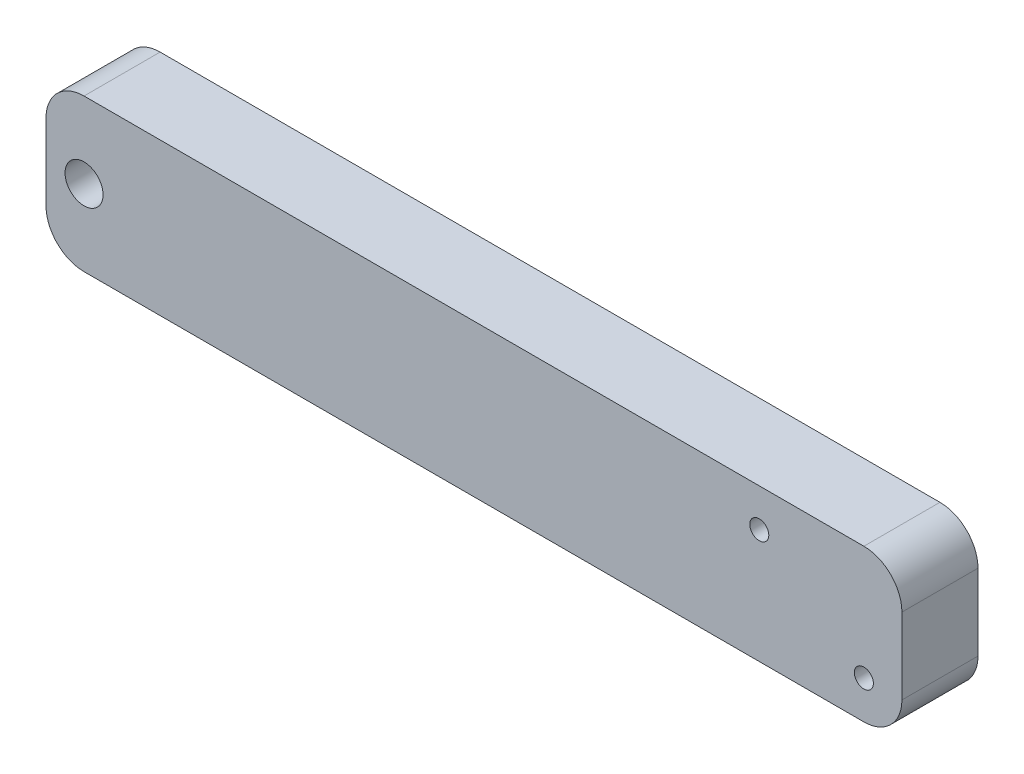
ISO-10303-21;
HEADER;
FILE_DESCRIPTION(('STEP AP214'),'2;1');
FILE_NAME('part.step','',(''),(''),'','','');
FILE_SCHEMA(('AUTOMOTIVE_DESIGN { 1 0 10303 214 1 1 1 1 }'));
ENDSEC;
DATA;
#1=APPLICATION_CONTEXT('core data for automotive mechanical design processes');
#2=APPLICATION_PROTOCOL_DEFINITION('international standard','automotive_design',2000,#1);
#3=PRODUCT_CONTEXT('',#1,'mechanical');
#4=PRODUCT('Part','Part','',(#3));
#5=PRODUCT_RELATED_PRODUCT_CATEGORY('part','',(#4));
#6=PRODUCT_DEFINITION_FORMATION('','',#4);
#7=PRODUCT_DEFINITION_CONTEXT('part definition',#1,'design');
#8=PRODUCT_DEFINITION('design','',#6,#7);
#9=PRODUCT_DEFINITION_SHAPE('','',#8);
#10=(LENGTH_UNIT() NAMED_UNIT(*) SI_UNIT(.MILLI.,.METRE.));
#11=(NAMED_UNIT(*) PLANE_ANGLE_UNIT() SI_UNIT($,.RADIAN.));
#12=(NAMED_UNIT(*) SI_UNIT($,.STERADIAN.) SOLID_ANGLE_UNIT());
#13=UNCERTAINTY_MEASURE_WITH_UNIT(LENGTH_MEASURE(1.E-05),#10,'distance_accuracy_value','');
#14=(GEOMETRIC_REPRESENTATION_CONTEXT(3) GLOBAL_UNCERTAINTY_ASSIGNED_CONTEXT((#13)) GLOBAL_UNIT_ASSIGNED_CONTEXT((#10,
#11,#12)) REPRESENTATION_CONTEXT('',''));
#15=CARTESIAN_POINT('',(0.,0.,0.));
#16=DIRECTION('',(0.,0.,1.));
#17=DIRECTION('',(1.,0.,0.));
#18=AXIS2_PLACEMENT_3D('',#15,#16,#17);
#19=CARTESIAN_POINT('',(-54.0427722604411,29.3342813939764,20.));
#20=DIRECTION('',(1.,0.,0.));
#21=DIRECTION('',(0.,1.,0.));
#22=AXIS2_PLACEMENT_3D('',#19,#20,#21);
#23=PLANE('',#22);
#24=DIRECTION('',(0.,-1.,0.));
#25=VECTOR('',#24,1.);
#26=CARTESIAN_POINT('',(-54.0427722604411,29.3342813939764,0.));
#27=LINE('',#26,#25);
#28=CARTESIAN_POINT('',(-54.0427722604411,19.3342813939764,0.));
#29=VERTEX_POINT('',#28);
#30=CARTESIAN_POINT('',(-54.0427722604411,-0.665718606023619,0.));
#31=VERTEX_POINT('',#30);
#32=EDGE_CURVE('E127',#29,#31,#27,.T.);
#33=ORIENTED_EDGE('',*,*,#32,.T.);
#34=DIRECTION('',(0.,0.,-1.));
#35=VECTOR('',#34,1.);
#36=CARTESIAN_POINT('',(-54.0427722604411,-0.665718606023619,20.));
#37=LINE('',#36,#35);
#38=CARTESIAN_POINT('',(-54.0427722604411,-0.665718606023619,20.));
#39=VERTEX_POINT('',#38);
#40=EDGE_CURVE('E104',#31,#39,#37,.F.);
#41=ORIENTED_EDGE('',*,*,#40,.T.);
#42=DIRECTION('',(0.,-1.,0.));
#43=VECTOR('',#42,1.);
#44=CARTESIAN_POINT('',(-54.0427722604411,29.3342813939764,20.));
#45=LINE('',#44,#43);
#46=CARTESIAN_POINT('',(-54.0427722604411,19.3342813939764,20.));
#47=VERTEX_POINT('',#46);
#48=EDGE_CURVE('E137',#47,#39,#45,.T.);
#49=ORIENTED_EDGE('',*,*,#48,.F.);
#50=DIRECTION('',(0.,0.,-1.));
#51=VECTOR('',#50,1.);
#52=CARTESIAN_POINT('',(-54.0427722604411,19.3342813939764,20.));
#53=LINE('',#52,#51);
#54=EDGE_CURVE('E109',#47,#29,#53,.T.);
#55=ORIENTED_EDGE('',*,*,#54,.T.);
#56=EDGE_LOOP('',(#33,#41,#49,#55));
#57=FACE_BOUND('',#56,.T.);
#58=ADVANCED_FACE('F32',(#57),#23,.F.);
#59=CARTESIAN_POINT('',(-54.0427722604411,-10.6657186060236,20.));
#60=DIRECTION('',(0.,1.,0.));
#61=DIRECTION('',(0.,0.,1.));
#62=AXIS2_PLACEMENT_3D('',#59,#60,#61);
#63=PLANE('',#62);
#64=DIRECTION('',(1.,0.,0.));
#65=VECTOR('',#64,1.);
#66=CARTESIAN_POINT('',(-54.0427722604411,-10.6657186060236,20.));
#67=LINE('',#66,#65);
#68=CARTESIAN_POINT('',(-44.0427722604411,-10.6657186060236,20.));
#69=VERTEX_POINT('',#68);
#70=CARTESIAN_POINT('',(160.957227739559,-10.6657186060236,20.));
#71=VERTEX_POINT('',#70);
#72=EDGE_CURVE('E119',#69,#71,#67,.T.);
#73=ORIENTED_EDGE('',*,*,#72,.F.);
#74=DIRECTION('',(0.,0.,-1.));
#75=VECTOR('',#74,1.);
#76=CARTESIAN_POINT('',(-44.0427722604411,-10.6657186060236,20.));
#77=LINE('',#76,#75);
#78=CARTESIAN_POINT('',(-44.0427722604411,-10.6657186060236,0.));
#79=VERTEX_POINT('',#78);
#80=EDGE_CURVE('E103',#69,#79,#77,.T.);
#81=ORIENTED_EDGE('',*,*,#80,.T.);
#82=DIRECTION('',(1.,0.,0.));
#83=VECTOR('',#82,1.);
#84=CARTESIAN_POINT('',(-54.0427722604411,-10.6657186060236,0.));
#85=LINE('',#84,#83);
#86=CARTESIAN_POINT('',(160.957227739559,-10.6657186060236,0.));
#87=VERTEX_POINT('',#86);
#88=EDGE_CURVE('E116',#79,#87,#85,.T.);
#89=ORIENTED_EDGE('',*,*,#88,.T.);
#90=DIRECTION('',(0.,0.,-1.));
#91=VECTOR('',#90,1.);
#92=CARTESIAN_POINT('',(160.957227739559,-10.6657186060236,20.));
#93=LINE('',#92,#91);
#94=EDGE_CURVE('E121',#87,#71,#93,.F.);
#95=ORIENTED_EDGE('',*,*,#94,.T.);
#96=EDGE_LOOP('',(#73,#81,#89,#95));
#97=FACE_BOUND('',#96,.T.);
#98=ADVANCED_FACE('F115',(#97),#63,.F.);
#99=CARTESIAN_POINT('',(170.957227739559,29.3342813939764,20.));
#100=DIRECTION('',(-1.,0.,0.));
#101=DIRECTION('',(0.,-1.,0.));
#102=AXIS2_PLACEMENT_3D('',#99,#100,#101);
#103=PLANE('',#102);
#104=DIRECTION('',(0.,1.,0.));
#105=VECTOR('',#104,1.);
#106=CARTESIAN_POINT('',(170.957227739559,29.3342813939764,20.));
#107=LINE('',#106,#105);
#108=CARTESIAN_POINT('',(170.957227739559,-0.665718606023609,20.));
#109=VERTEX_POINT('',#108);
#110=CARTESIAN_POINT('',(170.957227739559,19.3342813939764,20.));
#111=VERTEX_POINT('',#110);
#112=EDGE_CURVE('E160',#109,#111,#107,.T.);
#113=ORIENTED_EDGE('',*,*,#112,.F.);
#114=DIRECTION('',(0.,0.,-1.));
#115=VECTOR('',#114,1.);
#116=CARTESIAN_POINT('',(170.957227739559,-0.665718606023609,20.));
#117=LINE('',#116,#115);
#118=CARTESIAN_POINT('',(170.957227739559,-0.665718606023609,0.));
#119=VERTEX_POINT('',#118);
#120=EDGE_CURVE('E11',#109,#119,#117,.T.);
#121=ORIENTED_EDGE('',*,*,#120,.T.);
#122=DIRECTION('',(0.,1.,0.));
#123=VECTOR('',#122,1.);
#124=CARTESIAN_POINT('',(170.957227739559,29.3342813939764,0.));
#125=LINE('',#124,#123);
#126=CARTESIAN_POINT('',(170.957227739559,19.3342813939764,0.));
#127=VERTEX_POINT('',#126);
#128=EDGE_CURVE('E126',#119,#127,#125,.T.);
#129=ORIENTED_EDGE('',*,*,#128,.T.);
#130=DIRECTION('',(0.,0.,-1.));
#131=VECTOR('',#130,1.);
#132=CARTESIAN_POINT('',(170.957227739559,19.3342813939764,20.));
#133=LINE('',#132,#131);
#134=EDGE_CURVE('E40',#127,#111,#133,.F.);
#135=ORIENTED_EDGE('',*,*,#134,.T.);
#136=EDGE_LOOP('',(#113,#121,#129,#135));
#137=FACE_BOUND('',#136,.T.);
#138=ADVANCED_FACE('F159',(#137),#103,.F.);
#139=CARTESIAN_POINT('',(-54.0427722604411,29.3342813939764,20.));
#140=DIRECTION('',(0.,-1.,0.));
#141=DIRECTION('',(0.,0.,-1.));
#142=AXIS2_PLACEMENT_3D('',#139,#140,#141);
#143=PLANE('',#142);
#144=DIRECTION('',(-1.,0.,0.));
#145=VECTOR('',#144,1.);
#146=CARTESIAN_POINT('',(-54.0427722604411,29.3342813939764,0.));
#147=LINE('',#146,#145);
#148=CARTESIAN_POINT('',(160.957227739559,29.3342813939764,0.));
#149=VERTEX_POINT('',#148);
#150=CARTESIAN_POINT('',(-44.0427722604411,29.3342813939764,0.));
#151=VERTEX_POINT('',#150);
#152=EDGE_CURVE('E130',#149,#151,#147,.T.);
#153=ORIENTED_EDGE('',*,*,#152,.T.);
#154=DIRECTION('',(0.,0.,-1.));
#155=VECTOR('',#154,1.);
#156=CARTESIAN_POINT('',(-44.0427722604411,29.3342813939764,20.));
#157=LINE('',#156,#155);
#158=CARTESIAN_POINT('',(-44.0427722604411,29.3342813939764,20.));
#159=VERTEX_POINT('',#158);
#160=EDGE_CURVE('E47',#151,#159,#157,.F.);
#161=ORIENTED_EDGE('',*,*,#160,.T.);
#162=DIRECTION('',(-1.,0.,0.));
#163=VECTOR('',#162,1.);
#164=CARTESIAN_POINT('',(-54.0427722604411,29.3342813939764,20.));
#165=LINE('',#164,#163);
#166=CARTESIAN_POINT('',(160.957227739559,29.3342813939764,20.));
#167=VERTEX_POINT('',#166);
#168=EDGE_CURVE('E138',#167,#159,#165,.T.);
#169=ORIENTED_EDGE('',*,*,#168,.F.);
#170=DIRECTION('',(0.,0.,-1.));
#171=VECTOR('',#170,1.);
#172=CARTESIAN_POINT('',(160.957227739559,29.3342813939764,20.));
#173=LINE('',#172,#171);
#174=EDGE_CURVE('E153',#167,#149,#173,.T.);
#175=ORIENTED_EDGE('',*,*,#174,.T.);
#176=EDGE_LOOP('',(#153,#161,#169,#175));
#177=FACE_BOUND('',#176,.T.);
#178=ADVANCED_FACE('F169',(#177),#143,.F.);
#179=CARTESIAN_POINT('',(-54.0427722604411,-10.6657186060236,20.));
#180=DIRECTION('',(0.,0.,1.));
#181=DIRECTION('',(1.,0.,0.));
#182=AXIS2_PLACEMENT_3D('',#179,#180,#181);
#183=PLANE('',#182);
#184=CARTESIAN_POINT('',(-44.0427722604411,9.33428139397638,20.));
#185=DIRECTION('',(0.,0.,1.));
#186=DIRECTION('',(1.,0.,0.));
#187=AXIS2_PLACEMENT_3D('',#184,#185,#186);
#188=CIRCLE('',#187,5.);
#189=CARTESIAN_POINT('',(-39.0427722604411,9.33428139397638,20.));
#190=VERTEX_POINT('',#189);
#191=EDGE_CURVE('E191',#190,#190,#188,.F.);
#192=ORIENTED_EDGE('',*,*,#191,.T.);
#193=EDGE_LOOP('',(#192));
#194=FACE_BOUND('',#193,.T.);
#195=CARTESIAN_POINT('',(133.461773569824,19.3342813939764,20.));
#196=DIRECTION('',(0.,0.,1.));
#197=DIRECTION('',(1.,0.,0.));
#198=AXIS2_PLACEMENT_3D('',#195,#196,#197);
#199=CIRCLE('',#198,2.5);
#200=CARTESIAN_POINT('',(135.961773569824,19.3342813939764,20.));
#201=VERTEX_POINT('',#200);
#202=EDGE_CURVE('E185',#201,#201,#199,.F.);
#203=ORIENTED_EDGE('',*,*,#202,.T.);
#204=EDGE_LOOP('',(#203));
#205=FACE_BOUND('',#204,.T.);
#206=CARTESIAN_POINT('',(160.957227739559,-0.665718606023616,20.));
#207=DIRECTION('',(0.,0.,1.));
#208=DIRECTION('',(1.,0.,0.));
#209=AXIS2_PLACEMENT_3D('',#206,#207,#208);
#210=CIRCLE('',#209,2.5);
#211=CARTESIAN_POINT('',(163.457227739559,-0.665718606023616,20.));
#212=VERTEX_POINT('',#211);
#213=EDGE_CURVE('E179',#212,#212,#210,.F.);
#214=ORIENTED_EDGE('',*,*,#213,.T.);
#215=EDGE_LOOP('',(#214));
#216=FACE_BOUND('',#215,.T.);
#217=ORIENTED_EDGE('',*,*,#48,.T.);
#218=CARTESIAN_POINT('',(-44.0427722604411,-0.665718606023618,20.));
#219=DIRECTION('',(0.,0.,1.));
#220=DIRECTION('',(1.,0.,0.));
#221=AXIS2_PLACEMENT_3D('',#218,#219,#220);
#222=CIRCLE('',#221,10.);
#223=EDGE_CURVE('E151',#39,#69,#222,.T.);
#224=ORIENTED_EDGE('',*,*,#223,.T.);
#225=ORIENTED_EDGE('',*,*,#72,.T.);
#226=CARTESIAN_POINT('',(160.957227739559,-0.665718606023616,20.));
#227=DIRECTION('',(0.,0.,1.));
#228=DIRECTION('',(1.,0.,0.));
#229=AXIS2_PLACEMENT_3D('',#226,#227,#228);
#230=CIRCLE('',#229,10.);
#231=EDGE_CURVE('E147',#71,#109,#230,.T.);
#232=ORIENTED_EDGE('',*,*,#231,.T.);
#233=ORIENTED_EDGE('',*,*,#112,.T.);
#234=CARTESIAN_POINT('',(160.957227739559,19.3342813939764,20.));
#235=DIRECTION('',(0.,0.,1.));
#236=DIRECTION('',(1.,0.,0.));
#237=AXIS2_PLACEMENT_3D('',#234,#235,#236);
#238=CIRCLE('',#237,10.);
#239=EDGE_CURVE('E54',#111,#167,#238,.T.);
#240=ORIENTED_EDGE('',*,*,#239,.T.);
#241=ORIENTED_EDGE('',*,*,#168,.T.);
#242=CARTESIAN_POINT('',(-44.0427722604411,19.3342813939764,20.));
#243=DIRECTION('',(0.,0.,1.));
#244=DIRECTION('',(1.,0.,0.));
#245=AXIS2_PLACEMENT_3D('',#242,#243,#244);
#246=CIRCLE('',#245,10.);
#247=EDGE_CURVE('E149',#159,#47,#246,.T.);
#248=ORIENTED_EDGE('',*,*,#247,.T.);
#249=EDGE_LOOP('',(#217,#224,#225,#232,#233,#240,#241,#248));
#250=FACE_BOUND('',#249,.T.);
#251=ADVANCED_FACE('F164',(#194,#205,#216,#250),#183,.T.);
#252=CARTESIAN_POINT('',(-54.0427722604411,-10.6657186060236,0.));
#253=DIRECTION('',(0.,0.,1.));
#254=DIRECTION('',(1.,0.,0.));
#255=AXIS2_PLACEMENT_3D('',#252,#253,#254);
#256=PLANE('',#255);
#257=CARTESIAN_POINT('',(-44.0427722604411,9.33428139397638,0.));
#258=DIRECTION('',(0.,0.,-1.));
#259=DIRECTION('',(-1.,0.,0.));
#260=AXIS2_PLACEMENT_3D('',#257,#258,#259);
#261=CIRCLE('',#260,5.);
#262=CARTESIAN_POINT('',(-49.0427722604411,9.33428139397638,0.));
#263=VERTEX_POINT('',#262);
#264=EDGE_CURVE('E188',#263,#263,#261,.T.);
#265=ORIENTED_EDGE('',*,*,#264,.F.);
#266=EDGE_LOOP('',(#265));
#267=FACE_BOUND('',#266,.T.);
#268=CARTESIAN_POINT('',(133.461773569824,19.3342813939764,0.));
#269=DIRECTION('',(0.,0.,-1.));
#270=DIRECTION('',(-1.,0.,0.));
#271=AXIS2_PLACEMENT_3D('',#268,#269,#270);
#272=CIRCLE('',#271,2.5);
#273=CARTESIAN_POINT('',(130.961773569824,19.3342813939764,0.));
#274=VERTEX_POINT('',#273);
#275=EDGE_CURVE('E182',#274,#274,#272,.T.);
#276=ORIENTED_EDGE('',*,*,#275,.F.);
#277=EDGE_LOOP('',(#276));
#278=FACE_BOUND('',#277,.T.);
#279=CARTESIAN_POINT('',(160.957227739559,-0.665718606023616,0.));
#280=DIRECTION('',(0.,0.,-1.));
#281=DIRECTION('',(-1.,0.,0.));
#282=AXIS2_PLACEMENT_3D('',#279,#280,#281);
#283=CIRCLE('',#282,2.5);
#284=CARTESIAN_POINT('',(158.457227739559,-0.665718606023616,0.));
#285=VERTEX_POINT('',#284);
#286=EDGE_CURVE('E132',#285,#285,#283,.T.);
#287=ORIENTED_EDGE('',*,*,#286,.F.);
#288=EDGE_LOOP('',(#287));
#289=FACE_BOUND('',#288,.T.);
#290=ORIENTED_EDGE('',*,*,#88,.F.);
#291=CARTESIAN_POINT('',(-44.0427722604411,-0.665718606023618,0.));
#292=DIRECTION('',(0.,0.,1.));
#293=DIRECTION('',(1.,0.,0.));
#294=AXIS2_PLACEMENT_3D('',#291,#292,#293);
#295=CIRCLE('',#294,10.);
#296=EDGE_CURVE('E99',#79,#31,#295,.F.);
#297=ORIENTED_EDGE('',*,*,#296,.T.);
#298=ORIENTED_EDGE('',*,*,#32,.F.);
#299=CARTESIAN_POINT('',(-44.0427722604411,19.3342813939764,0.));
#300=DIRECTION('',(0.,0.,1.));
#301=DIRECTION('',(1.,0.,0.));
#302=AXIS2_PLACEMENT_3D('',#299,#300,#301);
#303=CIRCLE('',#302,10.);
#304=EDGE_CURVE('E110',#29,#151,#303,.F.);
#305=ORIENTED_EDGE('',*,*,#304,.T.);
#306=ORIENTED_EDGE('',*,*,#152,.F.);
#307=CARTESIAN_POINT('',(160.957227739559,19.3342813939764,0.));
#308=DIRECTION('',(0.,0.,1.));
#309=DIRECTION('',(1.,0.,0.));
#310=AXIS2_PLACEMENT_3D('',#307,#308,#309);
#311=CIRCLE('',#310,10.);
#312=EDGE_CURVE('E120',#149,#127,#311,.F.);
#313=ORIENTED_EDGE('',*,*,#312,.T.);
#314=ORIENTED_EDGE('',*,*,#128,.F.);
#315=CARTESIAN_POINT('',(160.957227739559,-0.665718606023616,0.));
#316=DIRECTION('',(0.,0.,1.));
#317=DIRECTION('',(1.,0.,0.));
#318=AXIS2_PLACEMENT_3D('',#315,#316,#317);
#319=CIRCLE('',#318,10.);
#320=EDGE_CURVE('E125',#119,#87,#319,.F.);
#321=ORIENTED_EDGE('',*,*,#320,.T.);
#322=EDGE_LOOP('',(#290,#297,#298,#305,#306,#313,#314,#321));
#323=FACE_BOUND('',#322,.T.);
#324=ADVANCED_FACE('F123',(#267,#278,#289,#323),#256,.F.);
#325=CARTESIAN_POINT('',(-44.0427722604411,-0.665718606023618,20.));
#326=DIRECTION('',(0.,0.,-1.));
#327=DIRECTION('',(-1.,0.,0.));
#328=AXIS2_PLACEMENT_3D('',#325,#326,#327);
#329=CYLINDRICAL_SURFACE('',#328,10.);
#330=ORIENTED_EDGE('',*,*,#223,.F.);
#331=ORIENTED_EDGE('',*,*,#40,.F.);
#332=ORIENTED_EDGE('',*,*,#296,.F.);
#333=ORIENTED_EDGE('',*,*,#80,.F.);
#334=EDGE_LOOP('',(#330,#331,#332,#333));
#335=FACE_BOUND('',#334,.T.);
#336=ADVANCED_FACE('F102',(#335),#329,.T.);
#337=CARTESIAN_POINT('',(-44.0427722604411,19.3342813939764,20.));
#338=DIRECTION('',(0.,0.,-1.));
#339=DIRECTION('',(-1.,0.,0.));
#340=AXIS2_PLACEMENT_3D('',#337,#338,#339);
#341=CYLINDRICAL_SURFACE('',#340,10.);
#342=ORIENTED_EDGE('',*,*,#247,.F.);
#343=ORIENTED_EDGE('',*,*,#160,.F.);
#344=ORIENTED_EDGE('',*,*,#304,.F.);
#345=ORIENTED_EDGE('',*,*,#54,.F.);
#346=EDGE_LOOP('',(#342,#343,#344,#345));
#347=FACE_BOUND('',#346,.T.);
#348=ADVANCED_FACE('F173',(#347),#341,.T.);
#349=CARTESIAN_POINT('',(160.957227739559,-0.665718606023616,20.));
#350=DIRECTION('',(0.,0.,-1.));
#351=DIRECTION('',(-1.,0.,0.));
#352=AXIS2_PLACEMENT_3D('',#349,#350,#351);
#353=CYLINDRICAL_SURFACE('',#352,10.);
#354=ORIENTED_EDGE('',*,*,#231,.F.);
#355=ORIENTED_EDGE('',*,*,#94,.F.);
#356=ORIENTED_EDGE('',*,*,#320,.F.);
#357=ORIENTED_EDGE('',*,*,#120,.F.);
#358=EDGE_LOOP('',(#354,#355,#356,#357));
#359=FACE_BOUND('',#358,.T.);
#360=ADVANCED_FACE('F217',(#359),#353,.T.);
#361=CARTESIAN_POINT('',(160.957227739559,19.3342813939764,20.));
#362=DIRECTION('',(0.,0.,-1.));
#363=DIRECTION('',(-1.,0.,0.));
#364=AXIS2_PLACEMENT_3D('',#361,#362,#363);
#365=CYLINDRICAL_SURFACE('',#364,10.);
#366=ORIENTED_EDGE('',*,*,#239,.F.);
#367=ORIENTED_EDGE('',*,*,#134,.F.);
#368=ORIENTED_EDGE('',*,*,#312,.F.);
#369=ORIENTED_EDGE('',*,*,#174,.F.);
#370=EDGE_LOOP('',(#366,#367,#368,#369));
#371=FACE_BOUND('',#370,.T.);
#372=ADVANCED_FACE('F34',(#371),#365,.T.);
#373=CARTESIAN_POINT('',(160.957227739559,-0.665718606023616,20.001));
#374=DIRECTION('',(0.,0.,-1.));
#375=DIRECTION('',(-1.,0.,0.));
#376=AXIS2_PLACEMENT_3D('',#373,#374,#375);
#377=CYLINDRICAL_SURFACE('',#376,2.5);
#378=ORIENTED_EDGE('',*,*,#213,.F.);
#379=EDGE_LOOP('',(#378));
#380=FACE_BOUND('',#379,.T.);
#381=ORIENTED_EDGE('',*,*,#286,.T.);
#382=EDGE_LOOP('',(#381));
#383=FACE_BOUND('',#382,.T.);
#384=ADVANCED_FACE('F206',(#380,#383),#377,.F.);
#385=CARTESIAN_POINT('',(133.461773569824,19.3342813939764,20.001));
#386=DIRECTION('',(0.,0.,-1.));
#387=DIRECTION('',(-1.,0.,0.));
#388=AXIS2_PLACEMENT_3D('',#385,#386,#387);
#389=CYLINDRICAL_SURFACE('',#388,2.5);
#390=ORIENTED_EDGE('',*,*,#202,.F.);
#391=EDGE_LOOP('',(#390));
#392=FACE_BOUND('',#391,.T.);
#393=ORIENTED_EDGE('',*,*,#275,.T.);
#394=EDGE_LOOP('',(#393));
#395=FACE_BOUND('',#394,.T.);
#396=ADVANCED_FACE('F208',(#392,#395),#389,.F.);
#397=CARTESIAN_POINT('',(-44.0427722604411,9.33428139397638,20.001));
#398=DIRECTION('',(0.,0.,-1.));
#399=DIRECTION('',(-1.,0.,0.));
#400=AXIS2_PLACEMENT_3D('',#397,#398,#399);
#401=CYLINDRICAL_SURFACE('',#400,5.);
#402=ORIENTED_EDGE('',*,*,#191,.F.);
#403=EDGE_LOOP('',(#402));
#404=FACE_BOUND('',#403,.T.);
#405=ORIENTED_EDGE('',*,*,#264,.T.);
#406=EDGE_LOOP('',(#405));
#407=FACE_BOUND('',#406,.T.);
#408=ADVANCED_FACE('F197',(#404,#407),#401,.F.);
#409=CLOSED_SHELL('',(#58,#98,#138,#178,#251,#324,#336,#348,#360,#372,#384,#396,#408));
#410=MANIFOLD_SOLID_BREP('B2',#409);
#411=ADVANCED_BREP_SHAPE_REPRESENTATION('',(#18,#410),#14);
#412=SHAPE_DEFINITION_REPRESENTATION(#9,#411);
ENDSEC;
END-ISO-10303-21;
